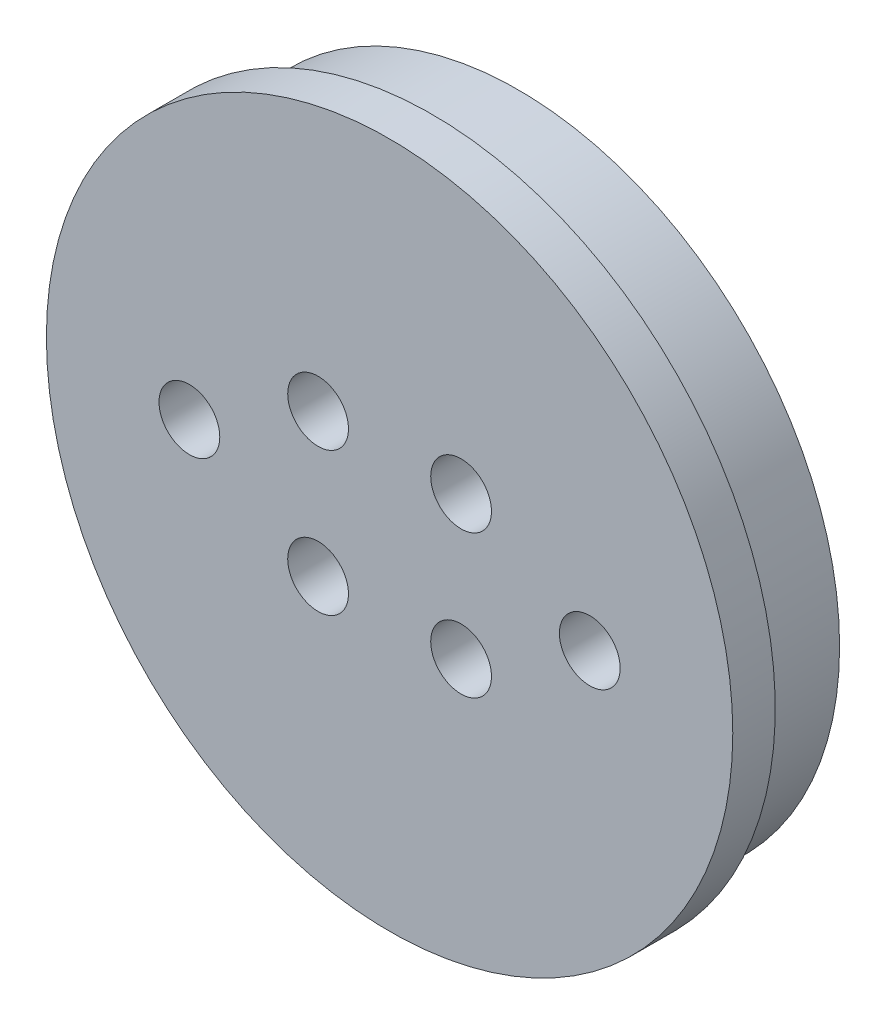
ISO-10303-21;
HEADER;
FILE_DESCRIPTION(('STEP AP214'),'2;1');
FILE_NAME('part.step','',(''),(''),'','','');
FILE_SCHEMA(('AUTOMOTIVE_DESIGN { 1 0 10303 214 1 1 1 1 }'));
ENDSEC;
DATA;
#1=APPLICATION_CONTEXT('core data for automotive mechanical design processes');
#2=APPLICATION_PROTOCOL_DEFINITION('international standard','automotive_design',2000,#1);
#3=PRODUCT_CONTEXT('',#1,'mechanical');
#4=PRODUCT('Part','Part','',(#3));
#5=PRODUCT_RELATED_PRODUCT_CATEGORY('part','',(#4));
#6=PRODUCT_DEFINITION_FORMATION('','',#4);
#7=PRODUCT_DEFINITION_CONTEXT('part definition',#1,'design');
#8=PRODUCT_DEFINITION('design','',#6,#7);
#9=PRODUCT_DEFINITION_SHAPE('','',#8);
#10=(LENGTH_UNIT() NAMED_UNIT(*) SI_UNIT(.MILLI.,.METRE.));
#11=(NAMED_UNIT(*) PLANE_ANGLE_UNIT() SI_UNIT($,.RADIAN.));
#12=(NAMED_UNIT(*) SI_UNIT($,.STERADIAN.) SOLID_ANGLE_UNIT());
#13=UNCERTAINTY_MEASURE_WITH_UNIT(LENGTH_MEASURE(1.E-05),#10,'distance_accuracy_value','');
#14=(GEOMETRIC_REPRESENTATION_CONTEXT(3) GLOBAL_UNCERTAINTY_ASSIGNED_CONTEXT((#13)) GLOBAL_UNIT_ASSIGNED_CONTEXT((#10,
#11,#12)) REPRESENTATION_CONTEXT('',''));
#15=CARTESIAN_POINT('',(0.,0.,0.));
#16=DIRECTION('',(0.,0.,1.));
#17=DIRECTION('',(1.,0.,0.));
#18=AXIS2_PLACEMENT_3D('',#15,#16,#17);
#19=CARTESIAN_POINT('',(0.,0.,6.03));
#20=DIRECTION('',(0.,0.,-1.));
#21=DIRECTION('',(0.,-1.,0.));
#22=AXIS2_PLACEMENT_3D('',#19,#20,#21);
#23=PLANE('',#22);
#24=CARTESIAN_POINT('',(0.,0.,6.03));
#25=DIRECTION('',(0.,0.,-1.));
#26=DIRECTION('',(-1.,0.,0.));
#27=AXIS2_PLACEMENT_3D('',#24,#25,#26);
#28=CIRCLE('',#27,22.47);
#29=CARTESIAN_POINT('',(-22.47,0.,6.03));
#30=VERTEX_POINT('',#29);
#31=EDGE_CURVE('E48',#30,#30,#28,.T.);
#32=ORIENTED_EDGE('',*,*,#31,.F.);
#33=EDGE_LOOP('',(#32));
#34=FACE_BOUND('',#33,.T.);
#35=CARTESIAN_POINT('',(0.,0.,6.03));
#36=DIRECTION('',(0.,0.,-1.));
#37=DIRECTION('',(-1.,0.,0.));
#38=AXIS2_PLACEMENT_3D('',#35,#36,#37);
#39=CIRCLE('',#38,24.);
#40=CARTESIAN_POINT('',(-24.,0.,6.03));
#41=VERTEX_POINT('',#40);
#42=EDGE_CURVE('E10',#41,#41,#39,.T.);
#43=ORIENTED_EDGE('',*,*,#42,.T.);
#44=EDGE_LOOP('',(#43));
#45=FACE_BOUND('',#44,.T.);
#46=ADVANCED_FACE('F15',(#34,#45),#23,.T.);
#47=CARTESIAN_POINT('',(0.,20.47,5.));
#48=DIRECTION('',(0.,0.,-1.));
#49=DIRECTION('',(0.,-1.,0.));
#50=AXIS2_PLACEMENT_3D('',#47,#48,#49);
#51=PLANE('',#50);
#52=CARTESIAN_POINT('',(0.,20.47,5.));
#53=DIRECTION('',(0.,0.,-1.));
#54=DIRECTION('',(-1.,0.,0.));
#55=AXIS2_PLACEMENT_3D('',#52,#53,#54);
#56=CIRCLE('',#55,1.25);
#57=CARTESIAN_POINT('',(-1.25,20.47,5.));
#58=VERTEX_POINT('',#57);
#59=EDGE_CURVE('E150',#58,#58,#56,.T.);
#60=ORIENTED_EDGE('',*,*,#59,.T.);
#61=EDGE_LOOP('',(#60));
#62=FACE_BOUND('',#61,.T.);
#63=ADVANCED_FACE('F17',(#62),#51,.T.);
#64=CARTESIAN_POINT('',(-17.7275400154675,-10.235,5.));
#65=DIRECTION('',(0.,0.,-1.));
#66=DIRECTION('',(0.,-1.,0.));
#67=AXIS2_PLACEMENT_3D('',#64,#65,#66);
#68=PLANE('',#67);
#69=CARTESIAN_POINT('',(-17.7275400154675,-10.235,5.));
#70=DIRECTION('',(0.,0.,-1.));
#71=DIRECTION('',(-1.,0.,0.));
#72=AXIS2_PLACEMENT_3D('',#69,#70,#71);
#73=CIRCLE('',#72,1.25);
#74=CARTESIAN_POINT('',(-18.9775400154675,-10.235,5.));
#75=VERTEX_POINT('',#74);
#76=EDGE_CURVE('E149',#75,#75,#73,.T.);
#77=ORIENTED_EDGE('',*,*,#76,.T.);
#78=EDGE_LOOP('',(#77));
#79=FACE_BOUND('',#78,.T.);
#80=ADVANCED_FACE('F85',(#79),#68,.T.);
#81=CARTESIAN_POINT('',(0.,-20.47,5.));
#82=DIRECTION('',(0.,0.,-1.));
#83=DIRECTION('',(0.,-1.,0.));
#84=AXIS2_PLACEMENT_3D('',#81,#82,#83);
#85=PLANE('',#84);
#86=CARTESIAN_POINT('',(0.,-20.47,5.));
#87=DIRECTION('',(0.,0.,-1.));
#88=DIRECTION('',(-1.,0.,0.));
#89=AXIS2_PLACEMENT_3D('',#86,#87,#88);
#90=CIRCLE('',#89,1.25000000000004);
#91=CARTESIAN_POINT('',(-1.25000000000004,-20.47,5.));
#92=VERTEX_POINT('',#91);
#93=EDGE_CURVE('E171',#92,#92,#90,.T.);
#94=ORIENTED_EDGE('',*,*,#93,.T.);
#95=EDGE_LOOP('',(#94));
#96=FACE_BOUND('',#95,.T.);
#97=ADVANCED_FACE('F555',(#96),#85,.T.);
#98=CARTESIAN_POINT('',(17.7275400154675,-10.235,5.));
#99=DIRECTION('',(0.,0.,-1.));
#100=DIRECTION('',(0.,-1.,0.));
#101=AXIS2_PLACEMENT_3D('',#98,#99,#100);
#102=PLANE('',#101);
#103=CARTESIAN_POINT('',(17.7275400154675,-10.235,5.));
#104=DIRECTION('',(0.,0.,-1.));
#105=DIRECTION('',(-1.,0.,0.));
#106=AXIS2_PLACEMENT_3D('',#103,#104,#105);
#107=CIRCLE('',#106,1.25);
#108=CARTESIAN_POINT('',(16.4775400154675,-10.235,5.));
#109=VERTEX_POINT('',#108);
#110=EDGE_CURVE('E156',#109,#109,#107,.T.);
#111=ORIENTED_EDGE('',*,*,#110,.T.);
#112=EDGE_LOOP('',(#111));
#113=FACE_BOUND('',#112,.T.);
#114=ADVANCED_FACE('F543',(#113),#102,.T.);
#115=CARTESIAN_POINT('',(17.7275400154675,10.235,5.));
#116=DIRECTION('',(0.,0.,-1.));
#117=DIRECTION('',(0.,-1.,0.));
#118=AXIS2_PLACEMENT_3D('',#115,#116,#117);
#119=PLANE('',#118);
#120=CARTESIAN_POINT('',(17.7275400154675,10.235,5.));
#121=DIRECTION('',(0.,0.,-1.));
#122=DIRECTION('',(-1.,0.,0.));
#123=AXIS2_PLACEMENT_3D('',#120,#121,#122);
#124=CIRCLE('',#123,1.25);
#125=CARTESIAN_POINT('',(16.4775400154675,10.235,5.));
#126=VERTEX_POINT('',#125);
#127=EDGE_CURVE('E155',#126,#126,#124,.T.);
#128=ORIENTED_EDGE('',*,*,#127,.T.);
#129=EDGE_LOOP('',(#128));
#130=FACE_BOUND('',#129,.T.);
#131=ADVANCED_FACE('F531',(#130),#119,.T.);
#132=CARTESIAN_POINT('',(-17.7275400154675,10.235,5.));
#133=DIRECTION('',(0.,0.,-1.));
#134=DIRECTION('',(0.,-1.,0.));
#135=AXIS2_PLACEMENT_3D('',#132,#133,#134);
#136=PLANE('',#135);
#137=CARTESIAN_POINT('',(-17.7275400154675,10.235,5.));
#138=DIRECTION('',(0.,0.,-1.));
#139=DIRECTION('',(-1.,0.,0.));
#140=AXIS2_PLACEMENT_3D('',#137,#138,#139);
#141=CIRCLE('',#140,1.25);
#142=CARTESIAN_POINT('',(-18.9775400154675,10.235,5.));
#143=VERTEX_POINT('',#142);
#144=EDGE_CURVE('E185',#143,#143,#141,.T.);
#145=ORIENTED_EDGE('',*,*,#144,.T.);
#146=EDGE_LOOP('',(#145));
#147=FACE_BOUND('',#146,.T.);
#148=ADVANCED_FACE('F73',(#147),#136,.T.);
#149=CARTESIAN_POINT('',(0.,0.,9.));
#150=DIRECTION('',(0.,0.,1.));
#151=DIRECTION('',(1.,0.,0.));
#152=AXIS2_PLACEMENT_3D('',#149,#150,#151);
#153=PLANE('',#152);
#154=CARTESIAN_POINT('',(-14.,0.,9.));
#155=DIRECTION('',(0.,0.,1.));
#156=DIRECTION('',(1.,0.,0.));
#157=AXIS2_PLACEMENT_3D('',#154,#155,#156);
#158=CIRCLE('',#157,2.125);
#159=CARTESIAN_POINT('',(-11.875,0.,9.));
#160=VERTEX_POINT('',#159);
#161=EDGE_CURVE('E167',#160,#160,#158,.T.);
#162=ORIENTED_EDGE('',*,*,#161,.F.);
#163=EDGE_LOOP('',(#162));
#164=FACE_BOUND('',#163,.T.);
#165=CARTESIAN_POINT('',(-5.,5.,9.));
#166=DIRECTION('',(0.,0.,-1.));
#167=DIRECTION('',(-1.,0.,0.));
#168=AXIS2_PLACEMENT_3D('',#165,#166,#167);
#169=CIRCLE('',#168,2.125);
#170=CARTESIAN_POINT('',(-7.125,5.,9.));
#171=VERTEX_POINT('',#170);
#172=EDGE_CURVE('E139',#171,#171,#169,.T.);
#173=ORIENTED_EDGE('',*,*,#172,.T.);
#174=EDGE_LOOP('',(#173));
#175=FACE_BOUND('',#174,.T.);
#176=CARTESIAN_POINT('',(-5.,-5.,9.));
#177=DIRECTION('',(0.,0.,-1.));
#178=DIRECTION('',(-1.,0.,0.));
#179=AXIS2_PLACEMENT_3D('',#176,#177,#178);
#180=CIRCLE('',#179,2.125);
#181=CARTESIAN_POINT('',(-7.125,-5.,9.));
#182=VERTEX_POINT('',#181);
#183=EDGE_CURVE('E124',#182,#182,#180,.T.);
#184=ORIENTED_EDGE('',*,*,#183,.T.);
#185=EDGE_LOOP('',(#184));
#186=FACE_BOUND('',#185,.T.);
#187=CARTESIAN_POINT('',(5.,-5.,9.));
#188=DIRECTION('',(0.,0.,-1.));
#189=DIRECTION('',(-1.,0.,0.));
#190=AXIS2_PLACEMENT_3D('',#187,#188,#189);
#191=CIRCLE('',#190,2.125);
#192=CARTESIAN_POINT('',(2.875,-5.,9.));
#193=VERTEX_POINT('',#192);
#194=EDGE_CURVE('E113',#193,#193,#191,.T.);
#195=ORIENTED_EDGE('',*,*,#194,.T.);
#196=EDGE_LOOP('',(#195));
#197=FACE_BOUND('',#196,.T.);
#198=CARTESIAN_POINT('',(14.,0.,9.));
#199=DIRECTION('',(0.,0.,-1.));
#200=DIRECTION('',(-1.,0.,0.));
#201=AXIS2_PLACEMENT_3D('',#198,#199,#200);
#202=CIRCLE('',#201,2.125);
#203=CARTESIAN_POINT('',(11.875,0.,9.));
#204=VERTEX_POINT('',#203);
#205=EDGE_CURVE('E43',#204,#204,#202,.T.);
#206=ORIENTED_EDGE('',*,*,#205,.T.);
#207=EDGE_LOOP('',(#206));
#208=FACE_BOUND('',#207,.T.);
#209=CARTESIAN_POINT('',(5.,5.,9.));
#210=DIRECTION('',(0.,0.,-1.));
#211=DIRECTION('',(-1.,0.,0.));
#212=AXIS2_PLACEMENT_3D('',#209,#210,#211);
#213=CIRCLE('',#212,2.125);
#214=CARTESIAN_POINT('',(2.875,5.,9.));
#215=VERTEX_POINT('',#214);
#216=EDGE_CURVE('E42',#215,#215,#213,.T.);
#217=ORIENTED_EDGE('',*,*,#216,.T.);
#218=EDGE_LOOP('',(#217));
#219=FACE_BOUND('',#218,.T.);
#220=CARTESIAN_POINT('',(0.,0.,9.));
#221=DIRECTION('',(0.,0.,1.));
#222=DIRECTION('',(1.,0.,0.));
#223=AXIS2_PLACEMENT_3D('',#220,#221,#222);
#224=CIRCLE('',#223,24.);
#225=CARTESIAN_POINT('',(24.,0.,9.));
#226=VERTEX_POINT('',#225);
#227=EDGE_CURVE('E19',#226,#226,#224,.T.);
#228=ORIENTED_EDGE('',*,*,#227,.T.);
#229=EDGE_LOOP('',(#228));
#230=FACE_BOUND('',#229,.T.);
#231=ADVANCED_FACE('F63',(#164,#175,#186,#197,#208,#219,#230),#153,.T.);
#232=CARTESIAN_POINT('',(0.,0.,0.));
#233=DIRECTION('',(0.,0.,1.));
#234=DIRECTION('',(1.,0.,0.));
#235=AXIS2_PLACEMENT_3D('',#232,#233,#234);
#236=PLANE('',#235);
#237=CARTESIAN_POINT('',(-14.,0.,0.));
#238=DIRECTION('',(0.,0.,1.));
#239=DIRECTION('',(1.,0.,0.));
#240=AXIS2_PLACEMENT_3D('',#237,#238,#239);
#241=CIRCLE('',#240,2.125);
#242=CARTESIAN_POINT('',(-11.875,0.,0.));
#243=VERTEX_POINT('',#242);
#244=EDGE_CURVE('E164',#243,#243,#241,.T.);
#245=ORIENTED_EDGE('',*,*,#244,.T.);
#246=EDGE_LOOP('',(#245));
#247=FACE_BOUND('',#246,.T.);
#248=CARTESIAN_POINT('',(5.,5.,0.));
#249=DIRECTION('',(0.,0.,-1.));
#250=DIRECTION('',(-1.,0.,0.));
#251=AXIS2_PLACEMENT_3D('',#248,#249,#250);
#252=CIRCLE('',#251,2.125);
#253=CARTESIAN_POINT('',(2.875,5.,0.));
#254=VERTEX_POINT('',#253);
#255=EDGE_CURVE('E44',#254,#254,#252,.T.);
#256=ORIENTED_EDGE('',*,*,#255,.F.);
#257=EDGE_LOOP('',(#256));
#258=FACE_BOUND('',#257,.T.);
#259=CARTESIAN_POINT('',(14.,0.,0.));
#260=DIRECTION('',(0.,0.,-1.));
#261=DIRECTION('',(-1.,0.,0.));
#262=AXIS2_PLACEMENT_3D('',#259,#260,#261);
#263=CIRCLE('',#262,2.125);
#264=CARTESIAN_POINT('',(11.875,0.,0.));
#265=VERTEX_POINT('',#264);
#266=EDGE_CURVE('E38',#265,#265,#263,.T.);
#267=ORIENTED_EDGE('',*,*,#266,.F.);
#268=EDGE_LOOP('',(#267));
#269=FACE_BOUND('',#268,.T.);
#270=CARTESIAN_POINT('',(5.,-5.,0.));
#271=DIRECTION('',(0.,0.,-1.));
#272=DIRECTION('',(-1.,0.,0.));
#273=AXIS2_PLACEMENT_3D('',#270,#271,#272);
#274=CIRCLE('',#273,2.125);
#275=CARTESIAN_POINT('',(2.875,-5.,0.));
#276=VERTEX_POINT('',#275);
#277=EDGE_CURVE('E36',#276,#276,#274,.T.);
#278=ORIENTED_EDGE('',*,*,#277,.F.);
#279=EDGE_LOOP('',(#278));
#280=FACE_BOUND('',#279,.T.);
#281=CARTESIAN_POINT('',(-5.,-5.,0.));
#282=DIRECTION('',(0.,0.,-1.));
#283=DIRECTION('',(-1.,0.,0.));
#284=AXIS2_PLACEMENT_3D('',#281,#282,#283);
#285=CIRCLE('',#284,2.125);
#286=CARTESIAN_POINT('',(-7.125,-5.,0.));
#287=VERTEX_POINT('',#286);
#288=EDGE_CURVE('E111',#287,#287,#285,.T.);
#289=ORIENTED_EDGE('',*,*,#288,.F.);
#290=EDGE_LOOP('',(#289));
#291=FACE_BOUND('',#290,.T.);
#292=CARTESIAN_POINT('',(-5.,5.,0.));
#293=DIRECTION('',(0.,0.,-1.));
#294=DIRECTION('',(-1.,0.,0.));
#295=AXIS2_PLACEMENT_3D('',#292,#293,#294);
#296=CIRCLE('',#295,2.125);
#297=CARTESIAN_POINT('',(-7.125,5.,0.));
#298=VERTEX_POINT('',#297);
#299=EDGE_CURVE('E131',#298,#298,#296,.T.);
#300=ORIENTED_EDGE('',*,*,#299,.F.);
#301=EDGE_LOOP('',(#300));
#302=FACE_BOUND('',#301,.T.);
#303=CARTESIAN_POINT('',(-17.7275400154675,10.235,0.));
#304=DIRECTION('',(0.,0.,-1.));
#305=DIRECTION('',(-1.,0.,0.));
#306=AXIS2_PLACEMENT_3D('',#303,#304,#305);
#307=CIRCLE('',#306,1.25);
#308=CARTESIAN_POINT('',(-18.9775400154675,10.235,0.));
#309=VERTEX_POINT('',#308);
#310=EDGE_CURVE('E189',#309,#309,#307,.T.);
#311=ORIENTED_EDGE('',*,*,#310,.F.);
#312=EDGE_LOOP('',(#311));
#313=FACE_BOUND('',#312,.T.);
#314=CARTESIAN_POINT('',(17.7275400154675,10.235,0.));
#315=DIRECTION('',(0.,0.,-1.));
#316=DIRECTION('',(-1.,0.,0.));
#317=AXIS2_PLACEMENT_3D('',#314,#315,#316);
#318=CIRCLE('',#317,1.25);
#319=CARTESIAN_POINT('',(16.4775400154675,10.235,0.));
#320=VERTEX_POINT('',#319);
#321=EDGE_CURVE('E181',#320,#320,#318,.T.);
#322=ORIENTED_EDGE('',*,*,#321,.F.);
#323=EDGE_LOOP('',(#322));
#324=FACE_BOUND('',#323,.T.);
#325=CARTESIAN_POINT('',(17.7275400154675,-10.235,0.));
#326=DIRECTION('',(0.,0.,-1.));
#327=DIRECTION('',(-1.,0.,0.));
#328=AXIS2_PLACEMENT_3D('',#325,#326,#327);
#329=CIRCLE('',#328,1.25);
#330=CARTESIAN_POINT('',(16.4775400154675,-10.235,0.));
#331=VERTEX_POINT('',#330);
#332=EDGE_CURVE('E151',#331,#331,#329,.T.);
#333=ORIENTED_EDGE('',*,*,#332,.F.);
#334=EDGE_LOOP('',(#333));
#335=FACE_BOUND('',#334,.T.);
#336=CARTESIAN_POINT('',(0.,-20.47,0.));
#337=DIRECTION('',(0.,0.,-1.));
#338=DIRECTION('',(-1.,0.,0.));
#339=AXIS2_PLACEMENT_3D('',#336,#337,#338);
#340=CIRCLE('',#339,1.25000000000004);
#341=CARTESIAN_POINT('',(-1.25000000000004,-20.47,0.));
#342=VERTEX_POINT('',#341);
#343=EDGE_CURVE('E143',#342,#342,#340,.T.);
#344=ORIENTED_EDGE('',*,*,#343,.F.);
#345=EDGE_LOOP('',(#344));
#346=FACE_BOUND('',#345,.T.);
#347=CARTESIAN_POINT('',(-17.7275400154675,-10.235,0.));
#348=DIRECTION('',(0.,0.,-1.));
#349=DIRECTION('',(-1.,0.,0.));
#350=AXIS2_PLACEMENT_3D('',#347,#348,#349);
#351=CIRCLE('',#350,1.25);
#352=CARTESIAN_POINT('',(-18.9775400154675,-10.235,0.));
#353=VERTEX_POINT('',#352);
#354=EDGE_CURVE('E160',#353,#353,#351,.T.);
#355=ORIENTED_EDGE('',*,*,#354,.F.);
#356=EDGE_LOOP('',(#355));
#357=FACE_BOUND('',#356,.T.);
#358=CARTESIAN_POINT('',(0.,20.47,0.));
#359=DIRECTION('',(0.,0.,-1.));
#360=DIRECTION('',(-1.,0.,0.));
#361=AXIS2_PLACEMENT_3D('',#358,#359,#360);
#362=CIRCLE('',#361,1.25);
#363=CARTESIAN_POINT('',(-1.25,20.47,0.));
#364=VERTEX_POINT('',#363);
#365=EDGE_CURVE('E145',#364,#364,#362,.T.);
#366=ORIENTED_EDGE('',*,*,#365,.F.);
#367=EDGE_LOOP('',(#366));
#368=FACE_BOUND('',#367,.T.);
#369=CARTESIAN_POINT('',(0.,0.,0.));
#370=DIRECTION('',(0.,0.,1.));
#371=DIRECTION('',(1.,0.,0.));
#372=AXIS2_PLACEMENT_3D('',#369,#370,#371);
#373=CIRCLE('',#372,22.47);
#374=CARTESIAN_POINT('',(22.47,0.,0.));
#375=VERTEX_POINT('',#374);
#376=EDGE_CURVE('E33',#375,#375,#373,.T.);
#377=ORIENTED_EDGE('',*,*,#376,.F.);
#378=EDGE_LOOP('',(#377));
#379=FACE_BOUND('',#378,.T.);
#380=ADVANCED_FACE('F60',(#247,#258,#269,#280,#291,#302,#313,#324,#335,#346,#357,#368,#379),
#236,.F.);
#381=CARTESIAN_POINT('',(0.,0.,9.));
#382=DIRECTION('',(0.,0.,-1.));
#383=DIRECTION('',(-1.,0.,0.));
#384=AXIS2_PLACEMENT_3D('',#381,#382,#383);
#385=CYLINDRICAL_SURFACE('',#384,24.);
#386=ORIENTED_EDGE('',*,*,#42,.F.);
#387=EDGE_LOOP('',(#386));
#388=FACE_BOUND('',#387,.T.);
#389=ORIENTED_EDGE('',*,*,#227,.F.);
#390=EDGE_LOOP('',(#389));
#391=FACE_BOUND('',#390,.T.);
#392=ADVANCED_FACE('F62',(#388,#391),#385,.T.);
#393=CARTESIAN_POINT('',(0.,0.,6.));
#394=DIRECTION('',(0.,0.,-1.));
#395=DIRECTION('',(-1.,0.,0.));
#396=AXIS2_PLACEMENT_3D('',#393,#394,#395);
#397=CYLINDRICAL_SURFACE('',#396,22.47);
#398=ORIENTED_EDGE('',*,*,#376,.T.);
#399=EDGE_LOOP('',(#398));
#400=FACE_BOUND('',#399,.T.);
#401=ORIENTED_EDGE('',*,*,#31,.T.);
#402=EDGE_LOOP('',(#401));
#403=FACE_BOUND('',#402,.T.);
#404=ADVANCED_FACE('F57',(#400,#403),#397,.T.);
#405=CARTESIAN_POINT('',(5.,5.,9.));
#406=DIRECTION('',(0.,0.,-1.));
#407=DIRECTION('',(-1.,0.,0.));
#408=AXIS2_PLACEMENT_3D('',#405,#406,#407);
#409=CYLINDRICAL_SURFACE('',#408,2.125);
#410=ORIENTED_EDGE('',*,*,#255,.T.);
#411=EDGE_LOOP('',(#410));
#412=FACE_BOUND('',#411,.T.);
#413=ORIENTED_EDGE('',*,*,#216,.F.);
#414=EDGE_LOOP('',(#413));
#415=FACE_BOUND('',#414,.T.);
#416=ADVANCED_FACE('F91',(#412,#415),#409,.F.);
#417=CARTESIAN_POINT('',(14.,0.,9.));
#418=DIRECTION('',(0.,0.,-1.));
#419=DIRECTION('',(-1.,0.,0.));
#420=AXIS2_PLACEMENT_3D('',#417,#418,#419);
#421=CYLINDRICAL_SURFACE('',#420,2.125);
#422=ORIENTED_EDGE('',*,*,#266,.T.);
#423=EDGE_LOOP('',(#422));
#424=FACE_BOUND('',#423,.T.);
#425=ORIENTED_EDGE('',*,*,#205,.F.);
#426=EDGE_LOOP('',(#425));
#427=FACE_BOUND('',#426,.T.);
#428=ADVANCED_FACE('F89',(#424,#427),#421,.F.);
#429=CARTESIAN_POINT('',(5.,-5.,9.));
#430=DIRECTION('',(0.,0.,-1.));
#431=DIRECTION('',(-1.,0.,0.));
#432=AXIS2_PLACEMENT_3D('',#429,#430,#431);
#433=CYLINDRICAL_SURFACE('',#432,2.125);
#434=ORIENTED_EDGE('',*,*,#277,.T.);
#435=EDGE_LOOP('',(#434));
#436=FACE_BOUND('',#435,.T.);
#437=ORIENTED_EDGE('',*,*,#194,.F.);
#438=EDGE_LOOP('',(#437));
#439=FACE_BOUND('',#438,.T.);
#440=ADVANCED_FACE('F98',(#436,#439),#433,.F.);
#441=CARTESIAN_POINT('',(-5.,-5.,9.));
#442=DIRECTION('',(0.,0.,-1.));
#443=DIRECTION('',(-1.,0.,0.));
#444=AXIS2_PLACEMENT_3D('',#441,#442,#443);
#445=CYLINDRICAL_SURFACE('',#444,2.125);
#446=ORIENTED_EDGE('',*,*,#288,.T.);
#447=EDGE_LOOP('',(#446));
#448=FACE_BOUND('',#447,.T.);
#449=ORIENTED_EDGE('',*,*,#183,.F.);
#450=EDGE_LOOP('',(#449));
#451=FACE_BOUND('',#450,.T.);
#452=ADVANCED_FACE('F205',(#448,#451),#445,.F.);
#453=CARTESIAN_POINT('',(-5.,5.,9.));
#454=DIRECTION('',(0.,0.,-1.));
#455=DIRECTION('',(-1.,0.,0.));
#456=AXIS2_PLACEMENT_3D('',#453,#454,#455);
#457=CYLINDRICAL_SURFACE('',#456,2.125);
#458=ORIENTED_EDGE('',*,*,#299,.T.);
#459=EDGE_LOOP('',(#458));
#460=FACE_BOUND('',#459,.T.);
#461=ORIENTED_EDGE('',*,*,#172,.F.);
#462=EDGE_LOOP('',(#461));
#463=FACE_BOUND('',#462,.T.);
#464=ADVANCED_FACE('F202',(#460,#463),#457,.F.);
#465=CARTESIAN_POINT('',(-14.,0.,9.));
#466=DIRECTION('',(0.,0.,-1.));
#467=DIRECTION('',(-1.,0.,0.));
#468=AXIS2_PLACEMENT_3D('',#465,#466,#467);
#469=CYLINDRICAL_SURFACE('',#468,2.125);
#470=ORIENTED_EDGE('',*,*,#244,.F.);
#471=EDGE_LOOP('',(#470));
#472=FACE_BOUND('',#471,.T.);
#473=ORIENTED_EDGE('',*,*,#161,.T.);
#474=EDGE_LOOP('',(#473));
#475=FACE_BOUND('',#474,.T.);
#476=ADVANCED_FACE('F204',(#472,#475),#469,.F.);
#477=CARTESIAN_POINT('',(-17.7275400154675,10.235,5.));
#478=DIRECTION('',(0.,0.,-1.));
#479=DIRECTION('',(-1.,0.,0.));
#480=AXIS2_PLACEMENT_3D('',#477,#478,#479);
#481=CYLINDRICAL_SURFACE('',#480,1.25);
#482=ORIENTED_EDGE('',*,*,#310,.T.);
#483=EDGE_LOOP('',(#482));
#484=FACE_BOUND('',#483,.T.);
#485=ORIENTED_EDGE('',*,*,#144,.F.);
#486=EDGE_LOOP('',(#485));
#487=FACE_BOUND('',#486,.T.);
#488=ADVANCED_FACE('F212',(#484,#487),#481,.F.);
#489=CARTESIAN_POINT('',(17.7275400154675,10.235,5.));
#490=DIRECTION('',(0.,0.,-1.));
#491=DIRECTION('',(-1.,0.,0.));
#492=AXIS2_PLACEMENT_3D('',#489,#490,#491);
#493=CYLINDRICAL_SURFACE('',#492,1.25);
#494=ORIENTED_EDGE('',*,*,#321,.T.);
#495=EDGE_LOOP('',(#494));
#496=FACE_BOUND('',#495,.T.);
#497=ORIENTED_EDGE('',*,*,#127,.F.);
#498=EDGE_LOOP('',(#497));
#499=FACE_BOUND('',#498,.T.);
#500=ADVANCED_FACE('F218',(#496,#499),#493,.F.);
#501=CARTESIAN_POINT('',(17.7275400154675,-10.235,5.));
#502=DIRECTION('',(0.,0.,-1.));
#503=DIRECTION('',(-1.,0.,0.));
#504=AXIS2_PLACEMENT_3D('',#501,#502,#503);
#505=CYLINDRICAL_SURFACE('',#504,1.25);
#506=ORIENTED_EDGE('',*,*,#332,.T.);
#507=EDGE_LOOP('',(#506));
#508=FACE_BOUND('',#507,.T.);
#509=ORIENTED_EDGE('',*,*,#110,.F.);
#510=EDGE_LOOP('',(#509));
#511=FACE_BOUND('',#510,.T.);
#512=ADVANCED_FACE('F412',(#508,#511),#505,.F.);
#513=CARTESIAN_POINT('',(0.,-20.47,5.));
#514=DIRECTION('',(0.,0.,-1.));
#515=DIRECTION('',(-1.,0.,0.));
#516=AXIS2_PLACEMENT_3D('',#513,#514,#515);
#517=CYLINDRICAL_SURFACE('',#516,1.25000000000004);
#518=ORIENTED_EDGE('',*,*,#343,.T.);
#519=EDGE_LOOP('',(#518));
#520=FACE_BOUND('',#519,.T.);
#521=ORIENTED_EDGE('',*,*,#93,.F.);
#522=EDGE_LOOP('',(#521));
#523=FACE_BOUND('',#522,.T.);
#524=ADVANCED_FACE('F400',(#520,#523),#517,.F.);
#525=CARTESIAN_POINT('',(-17.7275400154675,-10.235,5.));
#526=DIRECTION('',(0.,0.,-1.));
#527=DIRECTION('',(-1.,0.,0.));
#528=AXIS2_PLACEMENT_3D('',#525,#526,#527);
#529=CYLINDRICAL_SURFACE('',#528,1.25);
#530=ORIENTED_EDGE('',*,*,#354,.T.);
#531=EDGE_LOOP('',(#530));
#532=FACE_BOUND('',#531,.T.);
#533=ORIENTED_EDGE('',*,*,#76,.F.);
#534=EDGE_LOOP('',(#533));
#535=FACE_BOUND('',#534,.T.);
#536=ADVANCED_FACE('F249',(#532,#535),#529,.F.);
#537=CARTESIAN_POINT('',(0.,20.47,5.));
#538=DIRECTION('',(0.,0.,-1.));
#539=DIRECTION('',(-1.,0.,0.));
#540=AXIS2_PLACEMENT_3D('',#537,#538,#539);
#541=CYLINDRICAL_SURFACE('',#540,1.25);
#542=ORIENTED_EDGE('',*,*,#365,.T.);
#543=EDGE_LOOP('',(#542));
#544=FACE_BOUND('',#543,.T.);
#545=ORIENTED_EDGE('',*,*,#59,.F.);
#546=EDGE_LOOP('',(#545));
#547=FACE_BOUND('',#546,.T.);
#548=ADVANCED_FACE('F246',(#544,#547),#541,.F.);
#549=CLOSED_SHELL('',(#46,#63,#80,#97,#114,#131,#148,#231,#380,#392,#404,#416,#428,#440,#452,
#464,#476,#488,#500,#512,#524,#536,#548));
#550=MANIFOLD_SOLID_BREP('B1',#549);
#551=ADVANCED_BREP_SHAPE_REPRESENTATION('',(#18,#550),#14);
#552=SHAPE_DEFINITION_REPRESENTATION(#9,#551);
ENDSEC;
END-ISO-10303-21;
